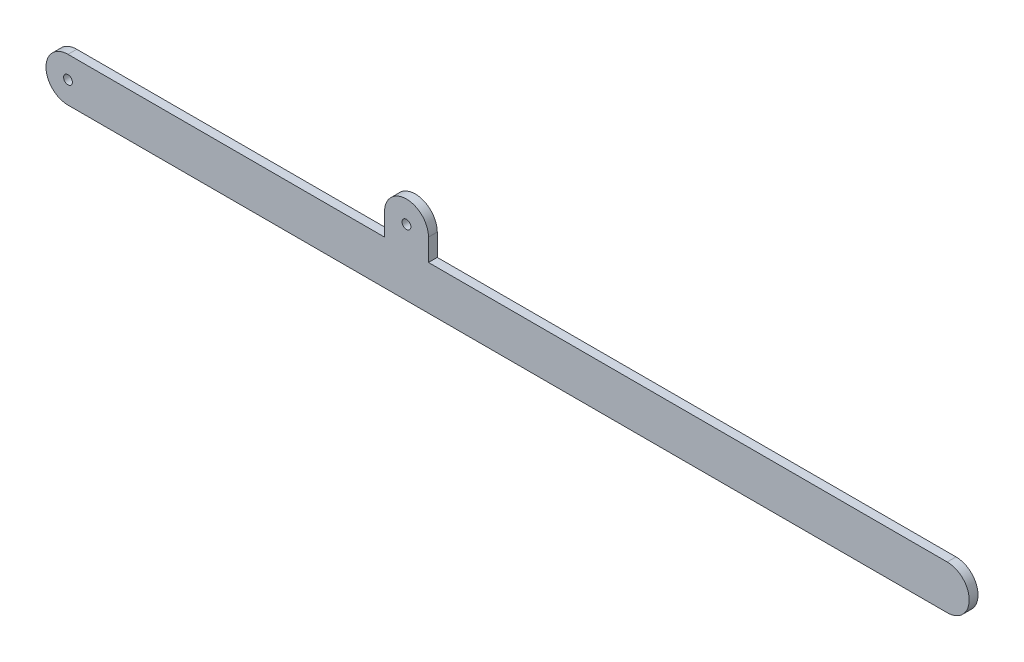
from build123d import *

# Parameters (mm, degrees)
BOSS_EXTRU_1_DEPTH      = 10
ESQUISSE2_R             = 5
ENL_V_MAT_EXTRU_1_DEPTH = 1028.788888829


with BuildPart() as part:
    # Esquisse1 → Boss.-Extru.1 (new body)
    with BuildSketch(Plane.XY):
        with BuildLine():
            Line((360, 25), (0, 25))
            ThreePointArc((0, 25), (-25, 0), (0, -25))
            Line((0, -25), (385, -25))
            ThreePointArc((385, -25), (367.32233047, -17.67766953), (360, 0))
            Line((360, 0), (360, 25))
        make_face()
        with BuildLine():
            Line((410, 25), (360, 25))
            Line((360, 25), (360, 0))
            ThreePointArc((360, 0), (367.32233047, -17.67766953), (385, -25))
            ThreePointArc((385, -25), (402.67766953, -17.67766953), (410, 0))
            Line((410, 0), (410, 25))
        make_face()
        with BuildLine():
            Line((360, 50), (360, 25))
            Line((360, 25), (410, 25))
            Line((410, 25), (410, 50))
            ThreePointArc((410, 50), (385, 75), (360, 50))
        make_face()
        with BuildLine():
            Line((1000, 25), (410, 25))
            Line((410, 25), (410, 0))
            ThreePointArc((410, 0), (402.67766953, -17.67766953), (385, -25))
            Line((385, -25), (1000, -25))
            ThreePointArc((1000, -25), (1025, 0), (1000, 25))
        make_face()
    extrude(amount=BOSS_EXTRU_1_DEPTH)

    # Esquisse2 → Enl_v. mat.-Extru.1 (cut, through all)
    with BuildSketch(Plane.XY.offset(10)):
        Circle(ESQUISSE2_R)
        with Locations((385, 50)):
            Circle(ESQUISSE2_R)
    extrude(amount=-ENL_V_MAT_EXTRU_1_DEPTH, mode=Mode.SUBTRACT)


solid = part.part
